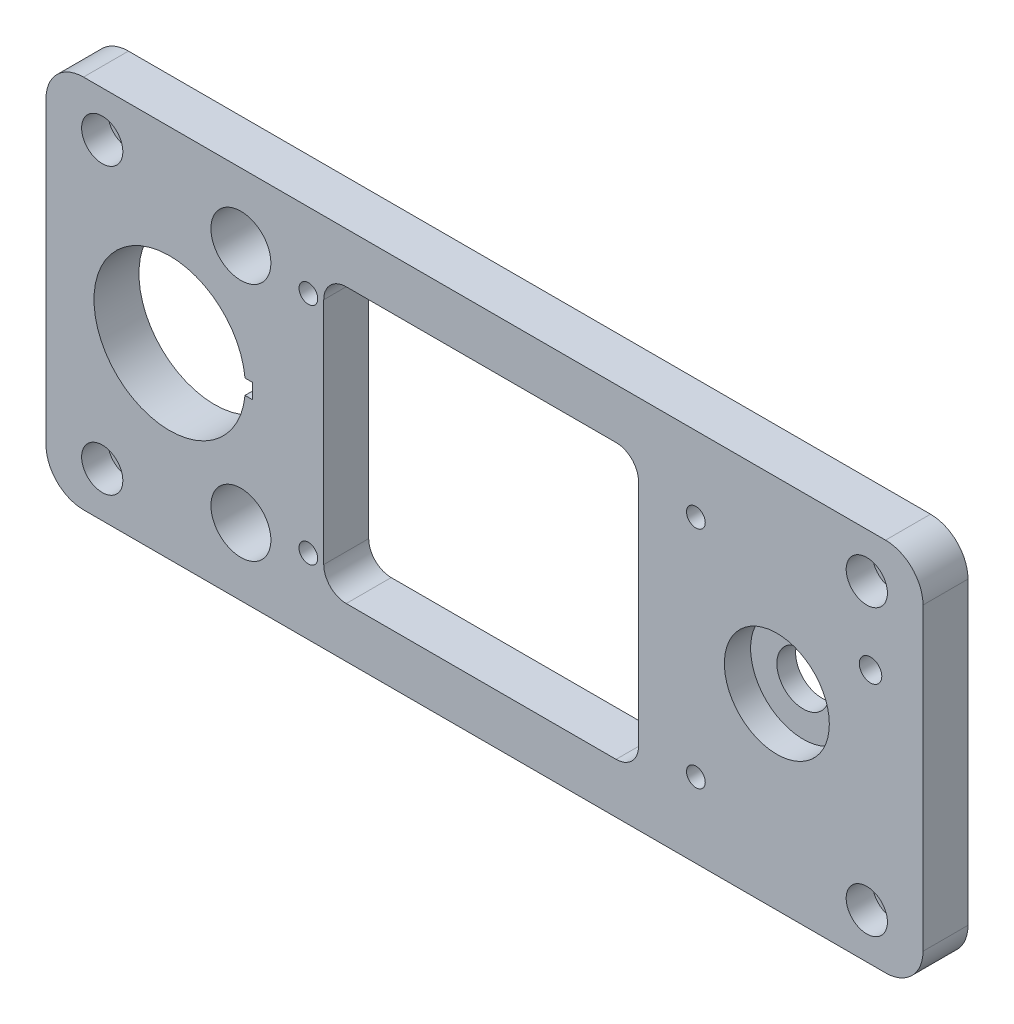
ISO-10303-21;
HEADER;
FILE_DESCRIPTION(('STEP AP214'),'2;1');
FILE_NAME('part.step','',(''),(''),'','','');
FILE_SCHEMA(('AUTOMOTIVE_DESIGN { 1 0 10303 214 1 1 1 1 }'));
ENDSEC;
DATA;
#1=APPLICATION_CONTEXT('core data for automotive mechanical design processes');
#2=APPLICATION_PROTOCOL_DEFINITION('international standard','automotive_design',2000,#1);
#3=PRODUCT_CONTEXT('',#1,'mechanical');
#4=PRODUCT('Part','Part','',(#3));
#5=PRODUCT_RELATED_PRODUCT_CATEGORY('part','',(#4));
#6=PRODUCT_DEFINITION_FORMATION('','',#4);
#7=PRODUCT_DEFINITION_CONTEXT('part definition',#1,'design');
#8=PRODUCT_DEFINITION('design','',#6,#7);
#9=PRODUCT_DEFINITION_SHAPE('','',#8);
#10=(LENGTH_UNIT() NAMED_UNIT(*) SI_UNIT(.MILLI.,.METRE.));
#11=(NAMED_UNIT(*) PLANE_ANGLE_UNIT() SI_UNIT($,.RADIAN.));
#12=(NAMED_UNIT(*) SI_UNIT($,.STERADIAN.) SOLID_ANGLE_UNIT());
#13=UNCERTAINTY_MEASURE_WITH_UNIT(LENGTH_MEASURE(1.E-05),#10,'distance_accuracy_value','');
#14=(GEOMETRIC_REPRESENTATION_CONTEXT(3) GLOBAL_UNCERTAINTY_ASSIGNED_CONTEXT((#13)) GLOBAL_UNIT_ASSIGNED_CONTEXT((#10,
#11,#12)) REPRESENTATION_CONTEXT('',''));
#15=CARTESIAN_POINT('',(0.,0.,0.));
#16=DIRECTION('',(0.,0.,1.));
#17=DIRECTION('',(1.,0.,0.));
#18=AXIS2_PLACEMENT_3D('',#15,#16,#17);
#19=CARTESIAN_POINT('',(97.500085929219,24.999938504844,6.));
#20=DIRECTION('',(0.,0.,-1.));
#21=DIRECTION('',(-1.,0.,0.));
#22=AXIS2_PLACEMENT_3D('',#19,#20,#21);
#23=CYLINDRICAL_SURFACE('',#22,3.50000000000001);
#24=CARTESIAN_POINT('',(97.500085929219,24.999938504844,0.));
#25=DIRECTION('',(0.,0.,1.));
#26=DIRECTION('',(1.,0.,0.));
#27=AXIS2_PLACEMENT_3D('',#24,#25,#26);
#28=CIRCLE('',#27,3.50000000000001);
#29=CARTESIAN_POINT('',(101.000085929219,24.999938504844,0.));
#30=VERTEX_POINT('',#29);
#31=EDGE_CURVE('E297',#30,#30,#28,.T.);
#32=ORIENTED_EDGE('',*,*,#31,.F.);
#33=EDGE_LOOP('',(#32));
#34=FACE_BOUND('',#33,.T.);
#35=CARTESIAN_POINT('',(97.500085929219,24.999938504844,2.5));
#36=DIRECTION('',(0.,0.,1.));
#37=DIRECTION('',(1.,0.,0.));
#38=AXIS2_PLACEMENT_3D('',#35,#36,#37);
#39=CIRCLE('',#38,3.50000000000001);
#40=CARTESIAN_POINT('',(101.000085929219,24.999938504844,2.5));
#41=VERTEX_POINT('',#40);
#42=EDGE_CURVE('E36',#41,#41,#39,.T.);
#43=ORIENTED_EDGE('',*,*,#42,.T.);
#44=EDGE_LOOP('',(#43));
#45=FACE_BOUND('',#44,.T.);
#46=ADVANCED_FACE('F32',(#34,#45),#23,.F.);
#47=CARTESIAN_POINT('',(109.5,6.00000000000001,6.));
#48=DIRECTION('',(0.,0.,-1.));
#49=DIRECTION('',(-1.,0.,0.));
#50=AXIS2_PLACEMENT_3D('',#47,#48,#49);
#51=CYLINDRICAL_SURFACE('',#50,1.75);
#52=CARTESIAN_POINT('',(109.5,6.00000000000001,0.));
#53=DIRECTION('',(0.,0.,1.));
#54=DIRECTION('',(1.,0.,0.));
#55=AXIS2_PLACEMENT_3D('',#52,#53,#54);
#56=CIRCLE('',#55,1.75);
#57=CARTESIAN_POINT('',(111.25,6.00000000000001,0.));
#58=VERTEX_POINT('',#57);
#59=EDGE_CURVE('E305',#58,#58,#56,.T.);
#60=ORIENTED_EDGE('',*,*,#59,.F.);
#61=EDGE_LOOP('',(#60));
#62=FACE_BOUND('',#61,.T.);
#63=CARTESIAN_POINT('',(109.5,6.00000000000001,2.5));
#64=DIRECTION('',(0.,0.,1.));
#65=DIRECTION('',(1.,0.,0.));
#66=AXIS2_PLACEMENT_3D('',#63,#64,#65);
#67=CIRCLE('',#66,1.75);
#68=CARTESIAN_POINT('',(111.25,6.00000000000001,2.5));
#69=VERTEX_POINT('',#68);
#70=EDGE_CURVE('E382',#69,#69,#67,.T.);
#71=ORIENTED_EDGE('',*,*,#70,.T.);
#72=EDGE_LOOP('',(#71));
#73=FACE_BOUND('',#72,.T.);
#74=ADVANCED_FACE('F440',(#62,#73),#51,.F.);
#75=CARTESIAN_POINT('',(109.5,44.,6.));
#76=DIRECTION('',(0.,0.,-1.));
#77=DIRECTION('',(-1.,0.,0.));
#78=AXIS2_PLACEMENT_3D('',#75,#76,#77);
#79=CYLINDRICAL_SURFACE('',#78,1.75);
#80=CARTESIAN_POINT('',(109.5,44.,0.));
#81=DIRECTION('',(0.,0.,1.));
#82=DIRECTION('',(-1.,0.,0.));
#83=AXIS2_PLACEMENT_3D('',#80,#81,#82);
#84=CIRCLE('',#83,1.75);
#85=CARTESIAN_POINT('',(107.75,44.,0.));
#86=VERTEX_POINT('',#85);
#87=EDGE_CURVE('E311',#86,#86,#84,.T.);
#88=ORIENTED_EDGE('',*,*,#87,.F.);
#89=EDGE_LOOP('',(#88));
#90=FACE_BOUND('',#89,.T.);
#91=CARTESIAN_POINT('',(109.5,44.,2.5));
#92=DIRECTION('',(0.,0.,1.));
#93=DIRECTION('',(1.,0.,0.));
#94=AXIS2_PLACEMENT_3D('',#91,#92,#93);
#95=CIRCLE('',#94,1.75);
#96=CARTESIAN_POINT('',(111.25,44.,2.5));
#97=VERTEX_POINT('',#96);
#98=EDGE_CURVE('E378',#97,#97,#95,.T.);
#99=ORIENTED_EDGE('',*,*,#98,.T.);
#100=EDGE_LOOP('',(#99));
#101=FACE_BOUND('',#100,.T.);
#102=ADVANCED_FACE('F446',(#90,#101),#79,.F.);
#103=CARTESIAN_POINT('',(7.49999999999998,6.00000000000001,6.));
#104=DIRECTION('',(0.,0.,-1.));
#105=DIRECTION('',(-1.,0.,0.));
#106=AXIS2_PLACEMENT_3D('',#103,#104,#105);
#107=CYLINDRICAL_SURFACE('',#106,1.75);
#108=CARTESIAN_POINT('',(7.49999999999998,6.00000000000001,0.));
#109=DIRECTION('',(0.,0.,1.));
#110=DIRECTION('',(-1.,0.,0.));
#111=AXIS2_PLACEMENT_3D('',#108,#109,#110);
#112=CIRCLE('',#111,1.75);
#113=CARTESIAN_POINT('',(5.74999999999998,6.00000000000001,0.));
#114=VERTEX_POINT('',#113);
#115=EDGE_CURVE('E302',#114,#114,#112,.T.);
#116=ORIENTED_EDGE('',*,*,#115,.F.);
#117=EDGE_LOOP('',(#116));
#118=FACE_BOUND('',#117,.T.);
#119=CARTESIAN_POINT('',(7.49999999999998,6.00000000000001,2.5));
#120=DIRECTION('',(0.,0.,1.));
#121=DIRECTION('',(1.,0.,0.));
#122=AXIS2_PLACEMENT_3D('',#119,#120,#121);
#123=CIRCLE('',#122,1.75);
#124=CARTESIAN_POINT('',(9.24999999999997,6.00000000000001,2.5));
#125=VERTEX_POINT('',#124);
#126=EDGE_CURVE('E373',#125,#125,#123,.T.);
#127=ORIENTED_EDGE('',*,*,#126,.T.);
#128=EDGE_LOOP('',(#127));
#129=FACE_BOUND('',#128,.T.);
#130=ADVANCED_FACE('F455',(#118,#129),#107,.F.);
#131=CARTESIAN_POINT('',(7.49999999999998,44.,6.));
#132=DIRECTION('',(0.,0.,-1.));
#133=DIRECTION('',(-1.,0.,0.));
#134=AXIS2_PLACEMENT_3D('',#131,#132,#133);
#135=CYLINDRICAL_SURFACE('',#134,1.75);
#136=CARTESIAN_POINT('',(7.49999999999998,44.,0.));
#137=DIRECTION('',(0.,0.,1.));
#138=DIRECTION('',(1.,0.,0.));
#139=AXIS2_PLACEMENT_3D('',#136,#137,#138);
#140=CIRCLE('',#139,1.75);
#141=CARTESIAN_POINT('',(9.24999999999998,44.,0.));
#142=VERTEX_POINT('',#141);
#143=EDGE_CURVE('E308',#142,#142,#140,.T.);
#144=ORIENTED_EDGE('',*,*,#143,.F.);
#145=EDGE_LOOP('',(#144));
#146=FACE_BOUND('',#145,.T.);
#147=CARTESIAN_POINT('',(7.49999999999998,44.,2.5));
#148=DIRECTION('',(0.,0.,1.));
#149=DIRECTION('',(1.,0.,0.));
#150=AXIS2_PLACEMENT_3D('',#147,#148,#149);
#151=CIRCLE('',#150,1.75);
#152=CARTESIAN_POINT('',(9.24999999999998,44.,2.5));
#153=VERTEX_POINT('',#152);
#154=EDGE_CURVE('E368',#153,#153,#151,.T.);
#155=ORIENTED_EDGE('',*,*,#154,.T.);
#156=EDGE_LOOP('',(#155));
#157=FACE_BOUND('',#156,.T.);
#158=ADVANCED_FACE('F457',(#146,#157),#135,.F.);
#159=CARTESIAN_POINT('',(5.,5.,6.));
#160=DIRECTION('',(0.,0.,-1.));
#161=DIRECTION('',(-1.,0.,0.));
#162=AXIS2_PLACEMENT_3D('',#159,#160,#161);
#163=PLANE('',#162);
#164=CARTESIAN_POINT('',(97.500085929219,24.999938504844,6.));
#165=DIRECTION('',(0.,0.,1.));
#166=DIRECTION('',(1.,0.,0.));
#167=AXIS2_PLACEMENT_3D('',#164,#165,#166);
#168=CIRCLE('',#167,7.);
#169=CARTESIAN_POINT('',(104.500085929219,24.999938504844,6.));
#170=VERTEX_POINT('',#169);
#171=EDGE_CURVE('E398',#170,#170,#168,.T.);
#172=ORIENTED_EDGE('',*,*,#171,.F.);
#173=EDGE_LOOP('',(#172));
#174=FACE_BOUND('',#173,.T.);
#175=CARTESIAN_POINT('',(109.5,6.00000000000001,6.));
#176=DIRECTION('',(0.,0.,1.));
#177=DIRECTION('',(1.,0.,0.));
#178=AXIS2_PLACEMENT_3D('',#175,#176,#177);
#179=CIRCLE('',#178,2.75000000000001);
#180=CARTESIAN_POINT('',(112.25,6.00000000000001,6.));
#181=VERTEX_POINT('',#180);
#182=EDGE_CURVE('E391',#181,#181,#179,.T.);
#183=ORIENTED_EDGE('',*,*,#182,.F.);
#184=EDGE_LOOP('',(#183));
#185=FACE_BOUND('',#184,.T.);
#186=CARTESIAN_POINT('',(109.5,44.,6.));
#187=DIRECTION('',(0.,0.,1.));
#188=DIRECTION('',(1.,0.,0.));
#189=AXIS2_PLACEMENT_3D('',#186,#187,#188);
#190=CIRCLE('',#189,2.75000000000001);
#191=CARTESIAN_POINT('',(112.25,44.,6.));
#192=VERTEX_POINT('',#191);
#193=EDGE_CURVE('E384',#192,#192,#190,.T.);
#194=ORIENTED_EDGE('',*,*,#193,.F.);
#195=EDGE_LOOP('',(#194));
#196=FACE_BOUND('',#195,.T.);
#197=CARTESIAN_POINT('',(7.49999999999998,6.00000000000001,6.));
#198=DIRECTION('',(0.,0.,1.));
#199=DIRECTION('',(1.,0.,0.));
#200=AXIS2_PLACEMENT_3D('',#197,#198,#199);
#201=CIRCLE('',#200,2.75);
#202=CARTESIAN_POINT('',(10.25,6.00000000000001,6.));
#203=VERTEX_POINT('',#202);
#204=EDGE_CURVE('E380',#203,#203,#201,.T.);
#205=ORIENTED_EDGE('',*,*,#204,.F.);
#206=EDGE_LOOP('',(#205));
#207=FACE_BOUND('',#206,.T.);
#208=CARTESIAN_POINT('',(7.49999999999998,44.,6.));
#209=DIRECTION('',(0.,0.,1.));
#210=DIRECTION('',(1.,0.,0.));
#211=AXIS2_PLACEMENT_3D('',#208,#209,#210);
#212=CIRCLE('',#211,2.75);
#213=CARTESIAN_POINT('',(10.25,44.,6.));
#214=VERTEX_POINT('',#213);
#215=EDGE_CURVE('E376',#214,#214,#212,.T.);
#216=ORIENTED_EDGE('',*,*,#215,.F.);
#217=EDGE_LOOP('',(#216));
#218=FACE_BOUND('',#217,.T.);
#219=CARTESIAN_POINT('',(26.,41.,6.));
#220=DIRECTION('',(0.,0.,1.));
#221=DIRECTION('',(1.,0.,0.));
#222=AXIS2_PLACEMENT_3D('',#219,#220,#221);
#223=CIRCLE('',#222,4.);
#224=CARTESIAN_POINT('',(30.,41.,6.));
#225=VERTEX_POINT('',#224);
#226=EDGE_CURVE('E201',#225,#225,#223,.T.);
#227=ORIENTED_EDGE('',*,*,#226,.F.);
#228=EDGE_LOOP('',(#227));
#229=FACE_BOUND('',#228,.T.);
#230=CARTESIAN_POINT('',(110.,34.,6.));
#231=DIRECTION('',(0.,0.,1.));
#232=DIRECTION('',(1.,0.,0.));
#233=AXIS2_PLACEMENT_3D('',#230,#231,#232);
#234=CIRCLE('',#233,1.5);
#235=CARTESIAN_POINT('',(111.5,34.,6.));
#236=VERTEX_POINT('',#235);
#237=EDGE_CURVE('E211',#236,#236,#234,.T.);
#238=ORIENTED_EDGE('',*,*,#237,.F.);
#239=EDGE_LOOP('',(#238));
#240=FACE_BOUND('',#239,.T.);
#241=CARTESIAN_POINT('',(35.00040108,40.00000238,6.));
#242=DIRECTION('',(0.,0.,1.));
#243=DIRECTION('',(1.,0.,0.));
#244=AXIS2_PLACEMENT_3D('',#241,#242,#243);
#245=CIRCLE('',#244,1.25);
#246=CARTESIAN_POINT('',(36.25040108,40.00000238,6.));
#247=VERTEX_POINT('',#246);
#248=EDGE_CURVE('E276',#247,#247,#245,.T.);
#249=ORIENTED_EDGE('',*,*,#248,.F.);
#250=EDGE_LOOP('',(#249));
#251=FACE_BOUND('',#250,.T.);
#252=CARTESIAN_POINT('',(35.00040108,10.00000142,6.));
#253=DIRECTION('',(0.,0.,1.));
#254=DIRECTION('',(1.,0.,0.));
#255=AXIS2_PLACEMENT_3D('',#252,#253,#254);
#256=CIRCLE('',#255,1.25);
#257=CARTESIAN_POINT('',(36.25040108,10.00000142,6.));
#258=VERTEX_POINT('',#257);
#259=EDGE_CURVE('E288',#258,#258,#256,.T.);
#260=ORIENTED_EDGE('',*,*,#259,.F.);
#261=EDGE_LOOP('',(#260));
#262=FACE_BOUND('',#261,.T.);
#263=CARTESIAN_POINT('',(5.,5.,6.));
#264=DIRECTION('',(0.,0.,1.));
#265=DIRECTION('',(-1.,0.,0.));
#266=AXIS2_PLACEMENT_3D('',#263,#264,#265);
#267=CIRCLE('',#266,5.);
#268=CARTESIAN_POINT('',(0.,5.,6.));
#269=VERTEX_POINT('',#268);
#270=CARTESIAN_POINT('',(5.,0.,6.));
#271=VERTEX_POINT('',#270);
#272=EDGE_CURVE('E315',#269,#271,#267,.T.);
#273=ORIENTED_EDGE('',*,*,#272,.T.);
#274=DIRECTION('',(1.,0.,0.));
#275=VECTOR('',#274,1.);
#276=CARTESIAN_POINT('',(5.,0.,6.));
#277=LINE('',#276,#275);
#278=CARTESIAN_POINT('',(112.,0.,6.));
#279=VERTEX_POINT('',#278);
#280=EDGE_CURVE('E318',#271,#279,#277,.T.);
#281=ORIENTED_EDGE('',*,*,#280,.T.);
#282=CARTESIAN_POINT('',(112.,5.00000000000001,6.));
#283=DIRECTION('',(0.,0.,1.));
#284=DIRECTION('',(1.,0.,0.));
#285=AXIS2_PLACEMENT_3D('',#282,#283,#284);
#286=CIRCLE('',#285,5.00000000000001);
#287=CARTESIAN_POINT('',(117.,5.00000000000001,6.));
#288=VERTEX_POINT('',#287);
#289=EDGE_CURVE('E321',#279,#288,#286,.T.);
#290=ORIENTED_EDGE('',*,*,#289,.T.);
#291=DIRECTION('',(0.,1.,0.));
#292=VECTOR('',#291,1.);
#293=CARTESIAN_POINT('',(117.,45.,6.));
#294=LINE('',#293,#292);
#295=CARTESIAN_POINT('',(117.,45.,6.));
#296=VERTEX_POINT('',#295);
#297=EDGE_CURVE('E323',#288,#296,#294,.T.);
#298=ORIENTED_EDGE('',*,*,#297,.T.);
#299=CARTESIAN_POINT('',(112.,45.,6.));
#300=DIRECTION('',(0.,0.,1.));
#301=DIRECTION('',(1.,0.,0.));
#302=AXIS2_PLACEMENT_3D('',#299,#300,#301);
#303=CIRCLE('',#302,5.00000000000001);
#304=CARTESIAN_POINT('',(112.,50.,6.));
#305=VERTEX_POINT('',#304);
#306=EDGE_CURVE('E325',#296,#305,#303,.T.);
#307=ORIENTED_EDGE('',*,*,#306,.T.);
#308=DIRECTION('',(-1.,0.,0.));
#309=VECTOR('',#308,1.);
#310=CARTESIAN_POINT('',(5.,50.,6.));
#311=LINE('',#310,#309);
#312=CARTESIAN_POINT('',(5.,50.,6.));
#313=VERTEX_POINT('',#312);
#314=EDGE_CURVE('E327',#305,#313,#311,.T.);
#315=ORIENTED_EDGE('',*,*,#314,.T.);
#316=CARTESIAN_POINT('',(4.99999999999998,45.,6.));
#317=DIRECTION('',(0.,0.,1.));
#318=DIRECTION('',(1.,0.,0.));
#319=AXIS2_PLACEMENT_3D('',#316,#317,#318);
#320=CIRCLE('',#319,5.00000000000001);
#321=CARTESIAN_POINT('',(0.,45.,6.));
#322=VERTEX_POINT('',#321);
#323=EDGE_CURVE('E329',#313,#322,#320,.T.);
#324=ORIENTED_EDGE('',*,*,#323,.T.);
#325=DIRECTION('',(0.,-1.,0.));
#326=VECTOR('',#325,1.);
#327=CARTESIAN_POINT('',(0.,5.,6.));
#328=LINE('',#327,#326);
#329=EDGE_CURVE('E331',#322,#269,#328,.T.);
#330=ORIENTED_EDGE('',*,*,#329,.T.);
#331=EDGE_LOOP('',(#273,#281,#290,#298,#307,#315,#324,#330));
#332=FACE_BOUND('',#331,.T.);
#333=CARTESIAN_POINT('',(86.70040182,40.00000238,6.));
#334=DIRECTION('',(0.,0.,1.));
#335=DIRECTION('',(1.,0.,0.));
#336=AXIS2_PLACEMENT_3D('',#333,#334,#335);
#337=CIRCLE('',#336,1.25000004);
#338=CARTESIAN_POINT('',(87.95040186,40.00000238,6.));
#339=VERTEX_POINT('',#338);
#340=EDGE_CURVE('E294',#339,#339,#337,.T.);
#341=ORIENTED_EDGE('',*,*,#340,.F.);
#342=EDGE_LOOP('',(#341));
#343=FACE_BOUND('',#342,.T.);
#344=CARTESIAN_POINT('',(86.70040182,10.00000142,6.));
#345=DIRECTION('',(0.,0.,1.));
#346=DIRECTION('',(1.,0.,0.));
#347=AXIS2_PLACEMENT_3D('',#344,#345,#346);
#348=CIRCLE('',#347,1.25);
#349=CARTESIAN_POINT('',(87.95040182,10.00000142,6.));
#350=VERTEX_POINT('',#349);
#351=EDGE_CURVE('E282',#350,#350,#348,.T.);
#352=ORIENTED_EDGE('',*,*,#351,.F.);
#353=EDGE_LOOP('',(#352));
#354=FACE_BOUND('',#353,.T.);
#355=CARTESIAN_POINT('',(40.0503543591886,9.70006031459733,6.));
#356=DIRECTION('',(0.,0.,1.));
#357=DIRECTION('',(-1.,0.,0.));
#358=AXIS2_PLACEMENT_3D('',#355,#356,#357);
#359=CIRCLE('',#358,3.);
#360=CARTESIAN_POINT('',(37.0503543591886,9.70006031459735,6.));
#361=VERTEX_POINT('',#360);
#362=CARTESIAN_POINT('',(40.0503543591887,6.70006031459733,6.));
#363=VERTEX_POINT('',#362);
#364=EDGE_CURVE('E217',#361,#363,#359,.T.);
#365=ORIENTED_EDGE('',*,*,#364,.F.);
#366=DIRECTION('',(0.,-1.,0.));
#367=VECTOR('',#366,1.);
#368=CARTESIAN_POINT('',(37.0503543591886,9.70006031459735,6.));
#369=LINE('',#368,#367);
#370=CARTESIAN_POINT('',(37.0503543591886,40.3000603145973,6.));
#371=VERTEX_POINT('',#370);
#372=EDGE_CURVE('E233',#371,#361,#369,.T.);
#373=ORIENTED_EDGE('',*,*,#372,.F.);
#374=CARTESIAN_POINT('',(40.0503543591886,40.3000603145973,6.));
#375=DIRECTION('',(0.,0.,1.));
#376=DIRECTION('',(1.,0.,0.));
#377=AXIS2_PLACEMENT_3D('',#374,#375,#376);
#378=CIRCLE('',#377,3.);
#379=CARTESIAN_POINT('',(40.0503543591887,43.3000603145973,6.));
#380=VERTEX_POINT('',#379);
#381=EDGE_CURVE('E230',#380,#371,#378,.T.);
#382=ORIENTED_EDGE('',*,*,#381,.F.);
#383=DIRECTION('',(-1.,0.,0.));
#384=VECTOR('',#383,1.);
#385=CARTESIAN_POINT('',(40.0503543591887,43.3000603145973,6.));
#386=LINE('',#385,#384);
#387=CARTESIAN_POINT('',(76.0503543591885,43.3000603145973,6.));
#388=VERTEX_POINT('',#387);
#389=EDGE_CURVE('E228',#388,#380,#386,.T.);
#390=ORIENTED_EDGE('',*,*,#389,.F.);
#391=CARTESIAN_POINT('',(76.0503543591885,40.3000603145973,6.));
#392=DIRECTION('',(0.,0.,1.));
#393=DIRECTION('',(-1.,0.,0.));
#394=AXIS2_PLACEMENT_3D('',#391,#392,#393);
#395=CIRCLE('',#394,3.);
#396=CARTESIAN_POINT('',(79.0503543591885,40.3000603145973,6.));
#397=VERTEX_POINT('',#396);
#398=EDGE_CURVE('E226',#397,#388,#395,.T.);
#399=ORIENTED_EDGE('',*,*,#398,.F.);
#400=DIRECTION('',(0.,1.,0.));
#401=VECTOR('',#400,1.);
#402=CARTESIAN_POINT('',(79.0503543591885,40.3000603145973,6.));
#403=LINE('',#402,#401);
#404=CARTESIAN_POINT('',(79.0503543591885,9.70006031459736,6.));
#405=VERTEX_POINT('',#404);
#406=EDGE_CURVE('E224',#405,#397,#403,.T.);
#407=ORIENTED_EDGE('',*,*,#406,.F.);
#408=CARTESIAN_POINT('',(76.0503543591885,9.70006031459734,6.));
#409=DIRECTION('',(0.,0.,1.));
#410=DIRECTION('',(-1.,0.,0.));
#411=AXIS2_PLACEMENT_3D('',#408,#409,#410);
#412=CIRCLE('',#411,3.);
#413=CARTESIAN_POINT('',(76.0503543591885,6.70006031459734,6.));
#414=VERTEX_POINT('',#413);
#415=EDGE_CURVE('E222',#414,#405,#412,.T.);
#416=ORIENTED_EDGE('',*,*,#415,.F.);
#417=DIRECTION('',(1.,0.,0.));
#418=VECTOR('',#417,1.);
#419=CARTESIAN_POINT('',(76.0503543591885,6.70006031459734,6.));
#420=LINE('',#419,#418);
#421=EDGE_CURVE('E219',#363,#414,#420,.T.);
#422=ORIENTED_EDGE('',*,*,#421,.F.);
#423=EDGE_LOOP('',(#365,#373,#382,#390,#399,#407,#416,#422));
#424=FACE_BOUND('',#423,.T.);
#425=DIRECTION('',(0.,1.,0.));
#426=VECTOR('',#425,1.);
#427=CARTESIAN_POINT('',(27.5503731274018,26.,6.));
#428=LINE('',#427,#426);
#429=CARTESIAN_POINT('',(27.5503731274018,24.,6.));
#430=VERTEX_POINT('',#429);
#431=CARTESIAN_POINT('',(27.5503731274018,26.,6.));
#432=VERTEX_POINT('',#431);
#433=EDGE_CURVE('E171',#430,#432,#428,.T.);
#434=ORIENTED_EDGE('',*,*,#433,.F.);
#435=DIRECTION('',(1.,0.,0.));
#436=VECTOR('',#435,1.);
#437=CARTESIAN_POINT('',(27.5503731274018,24.,6.));
#438=LINE('',#437,#436);
#439=CARTESIAN_POINT('',(26.5503731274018,24.,6.));
#440=VERTEX_POINT('',#439);
#441=EDGE_CURVE('E195',#440,#430,#438,.T.);
#442=ORIENTED_EDGE('',*,*,#441,.F.);
#443=CARTESIAN_POINT('',(16.5,25.,6.));
#444=DIRECTION('',(0.,0.,1.));
#445=DIRECTION('',(1.,0.,0.));
#446=AXIS2_PLACEMENT_3D('',#443,#444,#445);
#447=CIRCLE('',#446,10.1);
#448=CARTESIAN_POINT('',(26.5503731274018,26.,6.));
#449=VERTEX_POINT('',#448);
#450=EDGE_CURVE('E193',#449,#440,#447,.T.);
#451=ORIENTED_EDGE('',*,*,#450,.F.);
#452=DIRECTION('',(-1.,0.,0.));
#453=VECTOR('',#452,1.);
#454=CARTESIAN_POINT('',(27.5503731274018,26.,6.));
#455=LINE('',#454,#453);
#456=EDGE_CURVE('E179',#432,#449,#455,.T.);
#457=ORIENTED_EDGE('',*,*,#456,.F.);
#458=EDGE_LOOP('',(#434,#442,#451,#457));
#459=FACE_BOUND('',#458,.T.);
#460=CARTESIAN_POINT('',(26.,9.,6.));
#461=DIRECTION('',(0.,0.,1.));
#462=DIRECTION('',(-1.,0.,0.));
#463=AXIS2_PLACEMENT_3D('',#460,#461,#462);
#464=CIRCLE('',#463,4.);
#465=CARTESIAN_POINT('',(22.,9.,6.));
#466=VERTEX_POINT('',#465);
#467=EDGE_CURVE('E411',#466,#466,#464,.T.);
#468=ORIENTED_EDGE('',*,*,#467,.F.);
#469=EDGE_LOOP('',(#468));
#470=FACE_BOUND('',#469,.T.);
#471=ADVANCED_FACE('F191',(#174,#185,#196,#207,#218,#229,#240,#251,#262,#332,#343,#354,#424,
#459,#470),#163,.F.);
#472=CARTESIAN_POINT('',(5.,5.,0.));
#473=DIRECTION('',(0.,0.,-1.));
#474=DIRECTION('',(-1.,0.,0.));
#475=AXIS2_PLACEMENT_3D('',#472,#473,#474);
#476=PLANE('',#475);
#477=CARTESIAN_POINT('',(26.,41.,0.));
#478=DIRECTION('',(0.,0.,1.));
#479=DIRECTION('',(1.,0.,0.));
#480=AXIS2_PLACEMENT_3D('',#477,#478,#479);
#481=CIRCLE('',#480,4.);
#482=CARTESIAN_POINT('',(30.,41.,0.));
#483=VERTEX_POINT('',#482);
#484=EDGE_CURVE('E414',#483,#483,#481,.T.);
#485=ORIENTED_EDGE('',*,*,#484,.T.);
#486=EDGE_LOOP('',(#485));
#487=FACE_BOUND('',#486,.T.);
#488=CARTESIAN_POINT('',(110.,34.,0.));
#489=DIRECTION('',(0.,0.,1.));
#490=DIRECTION('',(1.,0.,0.));
#491=AXIS2_PLACEMENT_3D('',#488,#489,#490);
#492=CIRCLE('',#491,1.5);
#493=CARTESIAN_POINT('',(111.5,34.,0.));
#494=VERTEX_POINT('',#493);
#495=EDGE_CURVE('E187',#494,#494,#492,.T.);
#496=ORIENTED_EDGE('',*,*,#495,.T.);
#497=EDGE_LOOP('',(#496));
#498=FACE_BOUND('',#497,.T.);
#499=CARTESIAN_POINT('',(35.00040108,40.00000238,0.));
#500=DIRECTION('',(0.,0.,1.));
#501=DIRECTION('',(1.,0.,0.));
#502=AXIS2_PLACEMENT_3D('',#499,#500,#501);
#503=CIRCLE('',#502,1.25);
#504=CARTESIAN_POINT('',(36.25040108,40.00000238,0.));
#505=VERTEX_POINT('',#504);
#506=EDGE_CURVE('E275',#505,#505,#503,.T.);
#507=ORIENTED_EDGE('',*,*,#506,.T.);
#508=EDGE_LOOP('',(#507));
#509=FACE_BOUND('',#508,.T.);
#510=CARTESIAN_POINT('',(35.00040108,10.00000142,0.));
#511=DIRECTION('',(0.,0.,1.));
#512=DIRECTION('',(1.,0.,0.));
#513=AXIS2_PLACEMENT_3D('',#510,#511,#512);
#514=CIRCLE('',#513,1.25);
#515=CARTESIAN_POINT('',(36.25040108,10.00000142,0.));
#516=VERTEX_POINT('',#515);
#517=EDGE_CURVE('E285',#516,#516,#514,.T.);
#518=ORIENTED_EDGE('',*,*,#517,.T.);
#519=EDGE_LOOP('',(#518));
#520=FACE_BOUND('',#519,.T.);
#521=ORIENTED_EDGE('',*,*,#31,.T.);
#522=EDGE_LOOP('',(#521));
#523=FACE_BOUND('',#522,.T.);
#524=ORIENTED_EDGE('',*,*,#59,.T.);
#525=EDGE_LOOP('',(#524));
#526=FACE_BOUND('',#525,.T.);
#527=ORIENTED_EDGE('',*,*,#87,.T.);
#528=EDGE_LOOP('',(#527));
#529=FACE_BOUND('',#528,.T.);
#530=CARTESIAN_POINT('',(5.,5.,0.));
#531=DIRECTION('',(0.,0.,1.));
#532=DIRECTION('',(-1.,0.,0.));
#533=AXIS2_PLACEMENT_3D('',#530,#531,#532);
#534=CIRCLE('',#533,5.);
#535=CARTESIAN_POINT('',(0.,5.,0.));
#536=VERTEX_POINT('',#535);
#537=CARTESIAN_POINT('',(5.,0.,0.));
#538=VERTEX_POINT('',#537);
#539=EDGE_CURVE('E314',#536,#538,#534,.T.);
#540=ORIENTED_EDGE('',*,*,#539,.F.);
#541=DIRECTION('',(0.,-1.,0.));
#542=VECTOR('',#541,1.);
#543=CARTESIAN_POINT('',(0.,5.,0.));
#544=LINE('',#543,#542);
#545=CARTESIAN_POINT('',(0.,45.,0.));
#546=VERTEX_POINT('',#545);
#547=EDGE_CURVE('E319',#546,#536,#544,.T.);
#548=ORIENTED_EDGE('',*,*,#547,.F.);
#549=CARTESIAN_POINT('',(4.99999999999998,45.,0.));
#550=DIRECTION('',(0.,0.,1.));
#551=DIRECTION('',(1.,0.,0.));
#552=AXIS2_PLACEMENT_3D('',#549,#550,#551);
#553=CIRCLE('',#552,5.00000000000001);
#554=CARTESIAN_POINT('',(5.,50.,0.));
#555=VERTEX_POINT('',#554);
#556=EDGE_CURVE('E346',#555,#546,#553,.T.);
#557=ORIENTED_EDGE('',*,*,#556,.F.);
#558=DIRECTION('',(-1.,0.,0.));
#559=VECTOR('',#558,1.);
#560=CARTESIAN_POINT('',(5.,50.,0.));
#561=LINE('',#560,#559);
#562=CARTESIAN_POINT('',(112.,50.,0.));
#563=VERTEX_POINT('',#562);
#564=EDGE_CURVE('E344',#563,#555,#561,.T.);
#565=ORIENTED_EDGE('',*,*,#564,.F.);
#566=CARTESIAN_POINT('',(112.,45.,0.));
#567=DIRECTION('',(0.,0.,1.));
#568=DIRECTION('',(1.,0.,0.));
#569=AXIS2_PLACEMENT_3D('',#566,#567,#568);
#570=CIRCLE('',#569,5.00000000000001);
#571=CARTESIAN_POINT('',(117.,45.,0.));
#572=VERTEX_POINT('',#571);
#573=EDGE_CURVE('E342',#572,#563,#570,.T.);
#574=ORIENTED_EDGE('',*,*,#573,.F.);
#575=DIRECTION('',(0.,1.,0.));
#576=VECTOR('',#575,1.);
#577=CARTESIAN_POINT('',(117.,45.,0.));
#578=LINE('',#577,#576);
#579=CARTESIAN_POINT('',(117.,5.00000000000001,0.));
#580=VERTEX_POINT('',#579);
#581=EDGE_CURVE('E340',#580,#572,#578,.T.);
#582=ORIENTED_EDGE('',*,*,#581,.F.);
#583=CARTESIAN_POINT('',(112.,5.00000000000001,0.));
#584=DIRECTION('',(0.,0.,1.));
#585=DIRECTION('',(1.,0.,0.));
#586=AXIS2_PLACEMENT_3D('',#583,#584,#585);
#587=CIRCLE('',#586,5.00000000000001);
#588=CARTESIAN_POINT('',(112.,0.,0.));
#589=VERTEX_POINT('',#588);
#590=EDGE_CURVE('E338',#589,#580,#587,.T.);
#591=ORIENTED_EDGE('',*,*,#590,.F.);
#592=DIRECTION('',(1.,0.,0.));
#593=VECTOR('',#592,1.);
#594=CARTESIAN_POINT('',(5.,0.,0.));
#595=LINE('',#594,#593);
#596=EDGE_CURVE('E336',#538,#589,#595,.T.);
#597=ORIENTED_EDGE('',*,*,#596,.F.);
#598=EDGE_LOOP('',(#540,#548,#557,#565,#574,#582,#591,#597));
#599=FACE_BOUND('',#598,.T.);
#600=ORIENTED_EDGE('',*,*,#143,.T.);
#601=EDGE_LOOP('',(#600));
#602=FACE_BOUND('',#601,.T.);
#603=ORIENTED_EDGE('',*,*,#115,.T.);
#604=EDGE_LOOP('',(#603));
#605=FACE_BOUND('',#604,.T.);
#606=CARTESIAN_POINT('',(86.70040182,40.00000238,0.));
#607=DIRECTION('',(0.,0.,1.));
#608=DIRECTION('',(1.,0.,0.));
#609=AXIS2_PLACEMENT_3D('',#606,#607,#608);
#610=CIRCLE('',#609,1.25000004);
#611=CARTESIAN_POINT('',(87.95040186,40.00000238,0.));
#612=VERTEX_POINT('',#611);
#613=EDGE_CURVE('E291',#612,#612,#610,.T.);
#614=ORIENTED_EDGE('',*,*,#613,.T.);
#615=EDGE_LOOP('',(#614));
#616=FACE_BOUND('',#615,.T.);
#617=CARTESIAN_POINT('',(86.70040182,10.00000142,0.));
#618=DIRECTION('',(0.,0.,1.));
#619=DIRECTION('',(1.,0.,0.));
#620=AXIS2_PLACEMENT_3D('',#617,#618,#619);
#621=CIRCLE('',#620,1.25);
#622=CARTESIAN_POINT('',(87.95040182,10.00000142,0.));
#623=VERTEX_POINT('',#622);
#624=EDGE_CURVE('E279',#623,#623,#621,.T.);
#625=ORIENTED_EDGE('',*,*,#624,.T.);
#626=EDGE_LOOP('',(#625));
#627=FACE_BOUND('',#626,.T.);
#628=DIRECTION('',(0.,-1.,0.));
#629=VECTOR('',#628,1.);
#630=CARTESIAN_POINT('',(37.0503543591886,9.70006031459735,0.));
#631=LINE('',#630,#629);
#632=CARTESIAN_POINT('',(37.0503543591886,40.3000603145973,0.));
#633=VERTEX_POINT('',#632);
#634=CARTESIAN_POINT('',(37.0503543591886,9.70006031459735,0.));
#635=VERTEX_POINT('',#634);
#636=EDGE_CURVE('E220',#633,#635,#631,.T.);
#637=ORIENTED_EDGE('',*,*,#636,.T.);
#638=CARTESIAN_POINT('',(40.0503543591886,9.70006031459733,0.));
#639=DIRECTION('',(0.,0.,1.));
#640=DIRECTION('',(-1.,0.,0.));
#641=AXIS2_PLACEMENT_3D('',#638,#639,#640);
#642=CIRCLE('',#641,3.);
#643=CARTESIAN_POINT('',(40.0503543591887,6.70006031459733,0.));
#644=VERTEX_POINT('',#643);
#645=EDGE_CURVE('E214',#635,#644,#642,.T.);
#646=ORIENTED_EDGE('',*,*,#645,.T.);
#647=DIRECTION('',(1.,0.,0.));
#648=VECTOR('',#647,1.);
#649=CARTESIAN_POINT('',(76.0503543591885,6.70006031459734,0.));
#650=LINE('',#649,#648);
#651=CARTESIAN_POINT('',(76.0503543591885,6.70006031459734,0.));
#652=VERTEX_POINT('',#651);
#653=EDGE_CURVE('E238',#644,#652,#650,.T.);
#654=ORIENTED_EDGE('',*,*,#653,.T.);
#655=CARTESIAN_POINT('',(76.0503543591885,9.70006031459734,0.));
#656=DIRECTION('',(0.,0.,1.));
#657=DIRECTION('',(-1.,0.,0.));
#658=AXIS2_PLACEMENT_3D('',#655,#656,#657);
#659=CIRCLE('',#658,3.);
#660=CARTESIAN_POINT('',(79.0503543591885,9.70006031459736,0.));
#661=VERTEX_POINT('',#660);
#662=EDGE_CURVE('E241',#652,#661,#659,.T.);
#663=ORIENTED_EDGE('',*,*,#662,.T.);
#664=DIRECTION('',(0.,1.,0.));
#665=VECTOR('',#664,1.);
#666=CARTESIAN_POINT('',(79.0503543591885,40.3000603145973,0.));
#667=LINE('',#666,#665);
#668=CARTESIAN_POINT('',(79.0503543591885,40.3000603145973,0.));
#669=VERTEX_POINT('',#668);
#670=EDGE_CURVE('E244',#661,#669,#667,.T.);
#671=ORIENTED_EDGE('',*,*,#670,.T.);
#672=CARTESIAN_POINT('',(76.0503543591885,40.3000603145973,0.));
#673=DIRECTION('',(0.,0.,1.));
#674=DIRECTION('',(-1.,0.,0.));
#675=AXIS2_PLACEMENT_3D('',#672,#673,#674);
#676=CIRCLE('',#675,3.);
#677=CARTESIAN_POINT('',(76.0503543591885,43.3000603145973,0.));
#678=VERTEX_POINT('',#677);
#679=EDGE_CURVE('E247',#669,#678,#676,.T.);
#680=ORIENTED_EDGE('',*,*,#679,.T.);
#681=DIRECTION('',(-1.,0.,0.));
#682=VECTOR('',#681,1.);
#683=CARTESIAN_POINT('',(40.0503543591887,43.3000603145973,0.));
#684=LINE('',#683,#682);
#685=CARTESIAN_POINT('',(40.0503543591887,43.3000603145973,0.));
#686=VERTEX_POINT('',#685);
#687=EDGE_CURVE('E250',#678,#686,#684,.T.);
#688=ORIENTED_EDGE('',*,*,#687,.T.);
#689=CARTESIAN_POINT('',(40.0503543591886,40.3000603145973,0.));
#690=DIRECTION('',(0.,0.,1.));
#691=DIRECTION('',(1.,0.,0.));
#692=AXIS2_PLACEMENT_3D('',#689,#690,#691);
#693=CIRCLE('',#692,3.);
#694=EDGE_CURVE('E253',#686,#633,#693,.T.);
#695=ORIENTED_EDGE('',*,*,#694,.T.);
#696=EDGE_LOOP('',(#637,#646,#654,#663,#671,#680,#688,#695));
#697=FACE_BOUND('',#696,.T.);
#698=DIRECTION('',(1.,0.,0.));
#699=VECTOR('',#698,1.);
#700=CARTESIAN_POINT('',(27.5503731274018,24.,0.));
#701=LINE('',#700,#699);
#702=CARTESIAN_POINT('',(26.5503731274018,24.,0.));
#703=VERTEX_POINT('',#702);
#704=CARTESIAN_POINT('',(27.5503731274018,24.,0.));
#705=VERTEX_POINT('',#704);
#706=EDGE_CURVE('E180',#703,#705,#701,.T.);
#707=ORIENTED_EDGE('',*,*,#706,.T.);
#708=DIRECTION('',(0.,1.,0.));
#709=VECTOR('',#708,1.);
#710=CARTESIAN_POINT('',(27.5503731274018,26.,0.));
#711=LINE('',#710,#709);
#712=CARTESIAN_POINT('',(27.5503731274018,26.,0.));
#713=VERTEX_POINT('',#712);
#714=EDGE_CURVE('E57',#705,#713,#711,.T.);
#715=ORIENTED_EDGE('',*,*,#714,.T.);
#716=DIRECTION('',(-1.,0.,0.));
#717=VECTOR('',#716,1.);
#718=CARTESIAN_POINT('',(27.5503731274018,26.,0.));
#719=LINE('',#718,#717);
#720=CARTESIAN_POINT('',(26.5503731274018,26.,0.));
#721=VERTEX_POINT('',#720);
#722=EDGE_CURVE('E186',#713,#721,#719,.T.);
#723=ORIENTED_EDGE('',*,*,#722,.T.);
#724=CARTESIAN_POINT('',(16.5,25.,0.));
#725=DIRECTION('',(0.,0.,1.));
#726=DIRECTION('',(1.,0.,0.));
#727=AXIS2_PLACEMENT_3D('',#724,#725,#726);
#728=CIRCLE('',#727,10.1);
#729=EDGE_CURVE('E203',#721,#703,#728,.T.);
#730=ORIENTED_EDGE('',*,*,#729,.T.);
#731=EDGE_LOOP('',(#707,#715,#723,#730));
#732=FACE_BOUND('',#731,.T.);
#733=CARTESIAN_POINT('',(26.,9.,0.));
#734=DIRECTION('',(0.,0.,1.));
#735=DIRECTION('',(-1.,0.,0.));
#736=AXIS2_PLACEMENT_3D('',#733,#734,#735);
#737=CIRCLE('',#736,4.);
#738=CARTESIAN_POINT('',(22.,9.,0.));
#739=VERTEX_POINT('',#738);
#740=EDGE_CURVE('E371',#739,#739,#737,.T.);
#741=ORIENTED_EDGE('',*,*,#740,.T.);
#742=EDGE_LOOP('',(#741));
#743=FACE_BOUND('',#742,.T.);
#744=ADVANCED_FACE('F421',(#487,#498,#509,#520,#523,#526,#529,#599,#602,#605,#616,#627,#697,
#732,#743),#476,.T.);
#745=CARTESIAN_POINT('',(5.,5.,6.));
#746=DIRECTION('',(0.,0.,-1.));
#747=DIRECTION('',(-1.,0.,0.));
#748=AXIS2_PLACEMENT_3D('',#745,#746,#747);
#749=CYLINDRICAL_SURFACE('',#748,5.);
#750=ORIENTED_EDGE('',*,*,#539,.T.);
#751=DIRECTION('',(0.,0.,-1.));
#752=VECTOR('',#751,1.);
#753=CARTESIAN_POINT('',(5.,0.,6.));
#754=LINE('',#753,#752);
#755=EDGE_CURVE('E11',#271,#538,#754,.T.);
#756=ORIENTED_EDGE('',*,*,#755,.F.);
#757=ORIENTED_EDGE('',*,*,#272,.F.);
#758=DIRECTION('',(0.,0.,-1.));
#759=VECTOR('',#758,1.);
#760=CARTESIAN_POINT('',(0.,5.,6.));
#761=LINE('',#760,#759);
#762=EDGE_CURVE('E333',#269,#536,#761,.T.);
#763=ORIENTED_EDGE('',*,*,#762,.T.);
#764=EDGE_LOOP('',(#750,#756,#757,#763));
#765=FACE_BOUND('',#764,.T.);
#766=ADVANCED_FACE('F34',(#765),#749,.T.);
#767=CARTESIAN_POINT('',(5.,0.,6.));
#768=DIRECTION('',(0.,1.,0.));
#769=DIRECTION('',(-1.,0.,0.));
#770=AXIS2_PLACEMENT_3D('',#767,#768,#769);
#771=PLANE('',#770);
#772=ORIENTED_EDGE('',*,*,#596,.T.);
#773=DIRECTION('',(0.,0.,-1.));
#774=VECTOR('',#773,1.);
#775=CARTESIAN_POINT('',(112.,0.,6.));
#776=LINE('',#775,#774);
#777=EDGE_CURVE('E41',#279,#589,#776,.T.);
#778=ORIENTED_EDGE('',*,*,#777,.F.);
#779=ORIENTED_EDGE('',*,*,#280,.F.);
#780=ORIENTED_EDGE('',*,*,#755,.T.);
#781=EDGE_LOOP('',(#772,#778,#779,#780));
#782=FACE_BOUND('',#781,.T.);
#783=ADVANCED_FACE('F493',(#782),#771,.F.);
#784=CARTESIAN_POINT('',(112.,5.00000000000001,6.));
#785=DIRECTION('',(0.,0.,-1.));
#786=DIRECTION('',(-1.,0.,0.));
#787=AXIS2_PLACEMENT_3D('',#784,#785,#786);
#788=CYLINDRICAL_SURFACE('',#787,5.00000000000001);
#789=ORIENTED_EDGE('',*,*,#590,.T.);
#790=DIRECTION('',(0.,0.,-1.));
#791=VECTOR('',#790,1.);
#792=CARTESIAN_POINT('',(117.,5.00000000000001,6.));
#793=LINE('',#792,#791);
#794=EDGE_CURVE('E363',#288,#580,#793,.T.);
#795=ORIENTED_EDGE('',*,*,#794,.F.);
#796=ORIENTED_EDGE('',*,*,#289,.F.);
#797=ORIENTED_EDGE('',*,*,#777,.T.);
#798=EDGE_LOOP('',(#789,#795,#796,#797));
#799=FACE_BOUND('',#798,.T.);
#800=ADVANCED_FACE('F490',(#799),#788,.T.);
#801=CARTESIAN_POINT('',(117.,45.,6.));
#802=DIRECTION('',(-1.,0.,0.));
#803=DIRECTION('',(0.,0.,1.));
#804=AXIS2_PLACEMENT_3D('',#801,#802,#803);
#805=PLANE('',#804);
#806=ORIENTED_EDGE('',*,*,#581,.T.);
#807=DIRECTION('',(0.,0.,-1.));
#808=VECTOR('',#807,1.);
#809=CARTESIAN_POINT('',(117.,45.,6.));
#810=LINE('',#809,#808);
#811=EDGE_CURVE('E360',#296,#572,#810,.T.);
#812=ORIENTED_EDGE('',*,*,#811,.F.);
#813=ORIENTED_EDGE('',*,*,#297,.F.);
#814=ORIENTED_EDGE('',*,*,#794,.T.);
#815=EDGE_LOOP('',(#806,#812,#813,#814));
#816=FACE_BOUND('',#815,.T.);
#817=ADVANCED_FACE('F486',(#816),#805,.F.);
#818=CARTESIAN_POINT('',(112.,45.,6.));
#819=DIRECTION('',(0.,0.,-1.));
#820=DIRECTION('',(-1.,0.,0.));
#821=AXIS2_PLACEMENT_3D('',#818,#819,#820);
#822=CYLINDRICAL_SURFACE('',#821,5.00000000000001);
#823=ORIENTED_EDGE('',*,*,#573,.T.);
#824=DIRECTION('',(0.,0.,-1.));
#825=VECTOR('',#824,1.);
#826=CARTESIAN_POINT('',(112.,50.,6.));
#827=LINE('',#826,#825);
#828=EDGE_CURVE('E357',#305,#563,#827,.T.);
#829=ORIENTED_EDGE('',*,*,#828,.F.);
#830=ORIENTED_EDGE('',*,*,#306,.F.);
#831=ORIENTED_EDGE('',*,*,#811,.T.);
#832=EDGE_LOOP('',(#823,#829,#830,#831));
#833=FACE_BOUND('',#832,.T.);
#834=ADVANCED_FACE('F482',(#833),#822,.T.);
#835=CARTESIAN_POINT('',(5.,50.,6.));
#836=DIRECTION('',(0.,-1.,0.));
#837=DIRECTION('',(1.,0.,0.));
#838=AXIS2_PLACEMENT_3D('',#835,#836,#837);
#839=PLANE('',#838);
#840=ORIENTED_EDGE('',*,*,#564,.T.);
#841=DIRECTION('',(0.,0.,-1.));
#842=VECTOR('',#841,1.);
#843=CARTESIAN_POINT('',(5.,50.,6.));
#844=LINE('',#843,#842);
#845=EDGE_CURVE('E354',#313,#555,#844,.T.);
#846=ORIENTED_EDGE('',*,*,#845,.F.);
#847=ORIENTED_EDGE('',*,*,#314,.F.);
#848=ORIENTED_EDGE('',*,*,#828,.T.);
#849=EDGE_LOOP('',(#840,#846,#847,#848));
#850=FACE_BOUND('',#849,.T.);
#851=ADVANCED_FACE('F478',(#850),#839,.F.);
#852=CARTESIAN_POINT('',(4.99999999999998,45.,6.));
#853=DIRECTION('',(0.,0.,-1.));
#854=DIRECTION('',(-1.,0.,0.));
#855=AXIS2_PLACEMENT_3D('',#852,#853,#854);
#856=CYLINDRICAL_SURFACE('',#855,5.00000000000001);
#857=ORIENTED_EDGE('',*,*,#556,.T.);
#858=DIRECTION('',(0.,0.,-1.));
#859=VECTOR('',#858,1.);
#860=CARTESIAN_POINT('',(0.,45.,6.));
#861=LINE('',#860,#859);
#862=EDGE_CURVE('E351',#322,#546,#861,.T.);
#863=ORIENTED_EDGE('',*,*,#862,.F.);
#864=ORIENTED_EDGE('',*,*,#323,.F.);
#865=ORIENTED_EDGE('',*,*,#845,.T.);
#866=EDGE_LOOP('',(#857,#863,#864,#865));
#867=FACE_BOUND('',#866,.T.);
#868=ADVANCED_FACE('F474',(#867),#856,.T.);
#869=CARTESIAN_POINT('',(0.,5.,6.));
#870=DIRECTION('',(1.,0.,0.));
#871=DIRECTION('',(0.,1.,0.));
#872=AXIS2_PLACEMENT_3D('',#869,#870,#871);
#873=PLANE('',#872);
#874=ORIENTED_EDGE('',*,*,#547,.T.);
#875=ORIENTED_EDGE('',*,*,#762,.F.);
#876=ORIENTED_EDGE('',*,*,#329,.F.);
#877=ORIENTED_EDGE('',*,*,#862,.T.);
#878=EDGE_LOOP('',(#874,#875,#876,#877));
#879=FACE_BOUND('',#878,.T.);
#880=ADVANCED_FACE('F471',(#879),#873,.F.);
#881=CARTESIAN_POINT('',(86.70040182,40.00000238,6.));
#882=DIRECTION('',(0.,0.,-1.));
#883=DIRECTION('',(-1.,0.,0.));
#884=AXIS2_PLACEMENT_3D('',#881,#882,#883);
#885=CYLINDRICAL_SURFACE('',#884,1.25000004);
#886=ORIENTED_EDGE('',*,*,#340,.T.);
#887=EDGE_LOOP('',(#886));
#888=FACE_BOUND('',#887,.T.);
#889=ORIENTED_EDGE('',*,*,#613,.F.);
#890=EDGE_LOOP('',(#889));
#891=FACE_BOUND('',#890,.T.);
#892=ADVANCED_FACE('F453',(#888,#891),#885,.F.);
#893=CARTESIAN_POINT('',(35.00040108,10.00000142,6.));
#894=DIRECTION('',(0.,0.,-1.));
#895=DIRECTION('',(-1.,0.,0.));
#896=AXIS2_PLACEMENT_3D('',#893,#894,#895);
#897=CYLINDRICAL_SURFACE('',#896,1.25);
#898=ORIENTED_EDGE('',*,*,#259,.T.);
#899=EDGE_LOOP('',(#898));
#900=FACE_BOUND('',#899,.T.);
#901=ORIENTED_EDGE('',*,*,#517,.F.);
#902=EDGE_LOOP('',(#901));
#903=FACE_BOUND('',#902,.T.);
#904=ADVANCED_FACE('F588',(#900,#903),#897,.F.);
#905=CARTESIAN_POINT('',(86.70040182,10.00000142,6.));
#906=DIRECTION('',(0.,0.,-1.));
#907=DIRECTION('',(-1.,0.,0.));
#908=AXIS2_PLACEMENT_3D('',#905,#906,#907);
#909=CYLINDRICAL_SURFACE('',#908,1.25);
#910=ORIENTED_EDGE('',*,*,#351,.T.);
#911=EDGE_LOOP('',(#910));
#912=FACE_BOUND('',#911,.T.);
#913=ORIENTED_EDGE('',*,*,#624,.F.);
#914=EDGE_LOOP('',(#913));
#915=FACE_BOUND('',#914,.T.);
#916=ADVANCED_FACE('F585',(#912,#915),#909,.F.);
#917=CARTESIAN_POINT('',(35.00040108,40.00000238,6.));
#918=DIRECTION('',(0.,0.,-1.));
#919=DIRECTION('',(-1.,0.,0.));
#920=AXIS2_PLACEMENT_3D('',#917,#918,#919);
#921=CYLINDRICAL_SURFACE('',#920,1.25);
#922=ORIENTED_EDGE('',*,*,#248,.T.);
#923=EDGE_LOOP('',(#922));
#924=FACE_BOUND('',#923,.T.);
#925=ORIENTED_EDGE('',*,*,#506,.F.);
#926=EDGE_LOOP('',(#925));
#927=FACE_BOUND('',#926,.T.);
#928=ADVANCED_FACE('F582',(#924,#927),#921,.F.);
#929=CARTESIAN_POINT('',(40.0503543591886,9.70006031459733,6.));
#930=DIRECTION('',(0.,0.,-1.));
#931=DIRECTION('',(-1.,0.,0.));
#932=AXIS2_PLACEMENT_3D('',#929,#930,#931);
#933=CYLINDRICAL_SURFACE('',#932,3.);
#934=ORIENTED_EDGE('',*,*,#645,.F.);
#935=DIRECTION('',(0.,0.,-1.));
#936=VECTOR('',#935,1.);
#937=CARTESIAN_POINT('',(37.0503543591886,9.70006031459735,6.));
#938=LINE('',#937,#936);
#939=EDGE_CURVE('E235',#361,#635,#938,.T.);
#940=ORIENTED_EDGE('',*,*,#939,.F.);
#941=ORIENTED_EDGE('',*,*,#364,.T.);
#942=DIRECTION('',(0.,0.,-1.));
#943=VECTOR('',#942,1.);
#944=CARTESIAN_POINT('',(40.0503543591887,6.70006031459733,6.));
#945=LINE('',#944,#943);
#946=EDGE_CURVE('E272',#363,#644,#945,.T.);
#947=ORIENTED_EDGE('',*,*,#946,.T.);
#948=EDGE_LOOP('',(#934,#940,#941,#947));
#949=FACE_BOUND('',#948,.T.);
#950=ADVANCED_FACE('F539',(#949),#933,.F.);
#951=CARTESIAN_POINT('',(76.0503543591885,6.70006031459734,6.));
#952=DIRECTION('',(0.,1.,0.));
#953=DIRECTION('',(-1.,0.,0.));
#954=AXIS2_PLACEMENT_3D('',#951,#952,#953);
#955=PLANE('',#954);
#956=ORIENTED_EDGE('',*,*,#653,.F.);
#957=ORIENTED_EDGE('',*,*,#946,.F.);
#958=ORIENTED_EDGE('',*,*,#421,.T.);
#959=DIRECTION('',(0.,0.,-1.));
#960=VECTOR('',#959,1.);
#961=CARTESIAN_POINT('',(76.0503543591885,6.70006031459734,6.));
#962=LINE('',#961,#960);
#963=EDGE_CURVE('E270',#414,#652,#962,.T.);
#964=ORIENTED_EDGE('',*,*,#963,.T.);
#965=EDGE_LOOP('',(#956,#957,#958,#964));
#966=FACE_BOUND('',#965,.T.);
#967=ADVANCED_FACE('F541',(#966),#955,.T.);
#968=CARTESIAN_POINT('',(76.0503543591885,9.70006031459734,6.));
#969=DIRECTION('',(0.,0.,-1.));
#970=DIRECTION('',(-1.,0.,0.));
#971=AXIS2_PLACEMENT_3D('',#968,#969,#970);
#972=CYLINDRICAL_SURFACE('',#971,3.);
#973=ORIENTED_EDGE('',*,*,#662,.F.);
#974=ORIENTED_EDGE('',*,*,#963,.F.);
#975=ORIENTED_EDGE('',*,*,#415,.T.);
#976=DIRECTION('',(0.,0.,-1.));
#977=VECTOR('',#976,1.);
#978=CARTESIAN_POINT('',(79.0503543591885,9.70006031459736,6.));
#979=LINE('',#978,#977);
#980=EDGE_CURVE('E268',#405,#661,#979,.T.);
#981=ORIENTED_EDGE('',*,*,#980,.T.);
#982=EDGE_LOOP('',(#973,#974,#975,#981));
#983=FACE_BOUND('',#982,.T.);
#984=ADVANCED_FACE('F569',(#983),#972,.F.);
#985=CARTESIAN_POINT('',(79.0503543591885,40.3000603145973,6.));
#986=DIRECTION('',(-1.,0.,0.));
#987=DIRECTION('',(0.,0.,1.));
#988=AXIS2_PLACEMENT_3D('',#985,#986,#987);
#989=PLANE('',#988);
#990=ORIENTED_EDGE('',*,*,#670,.F.);
#991=ORIENTED_EDGE('',*,*,#980,.F.);
#992=ORIENTED_EDGE('',*,*,#406,.T.);
#993=DIRECTION('',(0.,0.,-1.));
#994=VECTOR('',#993,1.);
#995=CARTESIAN_POINT('',(79.0503543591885,40.3000603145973,6.));
#996=LINE('',#995,#994);
#997=EDGE_CURVE('E266',#397,#669,#996,.T.);
#998=ORIENTED_EDGE('',*,*,#997,.T.);
#999=EDGE_LOOP('',(#990,#991,#992,#998));
#1000=FACE_BOUND('',#999,.T.);
#1001=ADVANCED_FACE('F566',(#1000),#989,.T.);
#1002=CARTESIAN_POINT('',(76.0503543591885,40.3000603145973,6.));
#1003=DIRECTION('',(0.,0.,-1.));
#1004=DIRECTION('',(-1.,0.,0.));
#1005=AXIS2_PLACEMENT_3D('',#1002,#1003,#1004);
#1006=CYLINDRICAL_SURFACE('',#1005,3.);
#1007=ORIENTED_EDGE('',*,*,#679,.F.);
#1008=ORIENTED_EDGE('',*,*,#997,.F.);
#1009=ORIENTED_EDGE('',*,*,#398,.T.);
#1010=DIRECTION('',(0.,0.,-1.));
#1011=VECTOR('',#1010,1.);
#1012=CARTESIAN_POINT('',(76.0503543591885,43.3000603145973,6.));
#1013=LINE('',#1012,#1011);
#1014=EDGE_CURVE('E264',#388,#678,#1013,.T.);
#1015=ORIENTED_EDGE('',*,*,#1014,.T.);
#1016=EDGE_LOOP('',(#1007,#1008,#1009,#1015));
#1017=FACE_BOUND('',#1016,.T.);
#1018=ADVANCED_FACE('F562',(#1017),#1006,.F.);
#1019=CARTESIAN_POINT('',(40.0503543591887,43.3000603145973,6.));
#1020=DIRECTION('',(0.,-1.,0.));
#1021=DIRECTION('',(0.,0.,-1.));
#1022=AXIS2_PLACEMENT_3D('',#1019,#1020,#1021);
#1023=PLANE('',#1022);
#1024=ORIENTED_EDGE('',*,*,#687,.F.);
#1025=ORIENTED_EDGE('',*,*,#1014,.F.);
#1026=ORIENTED_EDGE('',*,*,#389,.T.);
#1027=DIRECTION('',(0.,0.,-1.));
#1028=VECTOR('',#1027,1.);
#1029=CARTESIAN_POINT('',(40.0503543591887,43.3000603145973,6.));
#1030=LINE('',#1029,#1028);
#1031=EDGE_CURVE('E262',#380,#686,#1030,.T.);
#1032=ORIENTED_EDGE('',*,*,#1031,.T.);
#1033=EDGE_LOOP('',(#1024,#1025,#1026,#1032));
#1034=FACE_BOUND('',#1033,.T.);
#1035=ADVANCED_FACE('F559',(#1034),#1023,.T.);
#1036=CARTESIAN_POINT('',(40.0503543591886,40.3000603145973,6.));
#1037=DIRECTION('',(0.,0.,-1.));
#1038=DIRECTION('',(-1.,0.,0.));
#1039=AXIS2_PLACEMENT_3D('',#1036,#1037,#1038);
#1040=CYLINDRICAL_SURFACE('',#1039,3.);
#1041=ORIENTED_EDGE('',*,*,#694,.F.);
#1042=ORIENTED_EDGE('',*,*,#1031,.F.);
#1043=ORIENTED_EDGE('',*,*,#381,.T.);
#1044=DIRECTION('',(0.,0.,-1.));
#1045=VECTOR('',#1044,1.);
#1046=CARTESIAN_POINT('',(37.0503543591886,40.3000603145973,6.));
#1047=LINE('',#1046,#1045);
#1048=EDGE_CURVE('E260',#371,#633,#1047,.T.);
#1049=ORIENTED_EDGE('',*,*,#1048,.T.);
#1050=EDGE_LOOP('',(#1041,#1042,#1043,#1049));
#1051=FACE_BOUND('',#1050,.T.);
#1052=ADVANCED_FACE('F552',(#1051),#1040,.F.);
#1053=CARTESIAN_POINT('',(37.0503543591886,9.70006031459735,6.));
#1054=DIRECTION('',(1.,0.,0.));
#1055=DIRECTION('',(0.,0.,-1.));
#1056=AXIS2_PLACEMENT_3D('',#1053,#1054,#1055);
#1057=PLANE('',#1056);
#1058=ORIENTED_EDGE('',*,*,#636,.F.);
#1059=ORIENTED_EDGE('',*,*,#1048,.F.);
#1060=ORIENTED_EDGE('',*,*,#372,.T.);
#1061=ORIENTED_EDGE('',*,*,#939,.T.);
#1062=EDGE_LOOP('',(#1058,#1059,#1060,#1061));
#1063=FACE_BOUND('',#1062,.T.);
#1064=ADVANCED_FACE('F548',(#1063),#1057,.T.);
#1065=CARTESIAN_POINT('',(110.,34.,6.));
#1066=DIRECTION('',(0.,0.,-1.));
#1067=DIRECTION('',(-1.,0.,0.));
#1068=AXIS2_PLACEMENT_3D('',#1065,#1066,#1067);
#1069=CYLINDRICAL_SURFACE('',#1068,1.5);
#1070=ORIENTED_EDGE('',*,*,#237,.T.);
#1071=EDGE_LOOP('',(#1070));
#1072=FACE_BOUND('',#1071,.T.);
#1073=ORIENTED_EDGE('',*,*,#495,.F.);
#1074=EDGE_LOOP('',(#1073));
#1075=FACE_BOUND('',#1074,.T.);
#1076=ADVANCED_FACE('F637',(#1072,#1075),#1069,.F.);
#1077=CARTESIAN_POINT('',(27.5503731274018,26.,6.));
#1078=DIRECTION('',(-1.,0.,0.));
#1079=DIRECTION('',(0.,0.,1.));
#1080=AXIS2_PLACEMENT_3D('',#1077,#1078,#1079);
#1081=PLANE('',#1080);
#1082=ORIENTED_EDGE('',*,*,#714,.F.);
#1083=DIRECTION('',(0.,0.,-1.));
#1084=VECTOR('',#1083,1.);
#1085=CARTESIAN_POINT('',(27.5503731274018,24.,6.));
#1086=LINE('',#1085,#1084);
#1087=EDGE_CURVE('E175',#430,#705,#1086,.T.);
#1088=ORIENTED_EDGE('',*,*,#1087,.F.);
#1089=ORIENTED_EDGE('',*,*,#433,.T.);
#1090=DIRECTION('',(0.,0.,-1.));
#1091=VECTOR('',#1090,1.);
#1092=CARTESIAN_POINT('',(27.5503731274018,26.,6.));
#1093=LINE('',#1092,#1091);
#1094=EDGE_CURVE('E174',#432,#713,#1093,.T.);
#1095=ORIENTED_EDGE('',*,*,#1094,.T.);
#1096=EDGE_LOOP('',(#1082,#1088,#1089,#1095));
#1097=FACE_BOUND('',#1096,.T.);
#1098=ADVANCED_FACE('F173',(#1097),#1081,.T.);
#1099=CARTESIAN_POINT('',(27.5503731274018,26.,6.));
#1100=DIRECTION('',(0.,-1.,0.));
#1101=DIRECTION('',(0.,0.,-1.));
#1102=AXIS2_PLACEMENT_3D('',#1099,#1100,#1101);
#1103=PLANE('',#1102);
#1104=ORIENTED_EDGE('',*,*,#722,.F.);
#1105=ORIENTED_EDGE('',*,*,#1094,.F.);
#1106=ORIENTED_EDGE('',*,*,#456,.T.);
#1107=DIRECTION('',(0.,0.,-1.));
#1108=VECTOR('',#1107,1.);
#1109=CARTESIAN_POINT('',(26.5503731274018,26.,6.));
#1110=LINE('',#1109,#1108);
#1111=EDGE_CURVE('E188',#449,#721,#1110,.T.);
#1112=ORIENTED_EDGE('',*,*,#1111,.T.);
#1113=EDGE_LOOP('',(#1104,#1105,#1106,#1112));
#1114=FACE_BOUND('',#1113,.T.);
#1115=ADVANCED_FACE('F183',(#1114),#1103,.T.);
#1116=CARTESIAN_POINT('',(16.5,25.,6.));
#1117=DIRECTION('',(0.,0.,-1.));
#1118=DIRECTION('',(-1.,0.,0.));
#1119=AXIS2_PLACEMENT_3D('',#1116,#1117,#1118);
#1120=CYLINDRICAL_SURFACE('',#1119,10.1);
#1121=ORIENTED_EDGE('',*,*,#729,.F.);
#1122=ORIENTED_EDGE('',*,*,#1111,.F.);
#1123=ORIENTED_EDGE('',*,*,#450,.T.);
#1124=DIRECTION('',(0.,0.,-1.));
#1125=VECTOR('',#1124,1.);
#1126=CARTESIAN_POINT('',(26.5503731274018,24.,6.));
#1127=LINE('',#1126,#1125);
#1128=EDGE_CURVE('E49',#440,#703,#1127,.T.);
#1129=ORIENTED_EDGE('',*,*,#1128,.T.);
#1130=EDGE_LOOP('',(#1121,#1122,#1123,#1129));
#1131=FACE_BOUND('',#1130,.T.);
#1132=ADVANCED_FACE('F437',(#1131),#1120,.F.);
#1133=CARTESIAN_POINT('',(27.5503731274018,24.,6.));
#1134=DIRECTION('',(0.,1.,0.));
#1135=DIRECTION('',(0.,0.,1.));
#1136=AXIS2_PLACEMENT_3D('',#1133,#1134,#1135);
#1137=PLANE('',#1136);
#1138=ORIENTED_EDGE('',*,*,#706,.F.);
#1139=ORIENTED_EDGE('',*,*,#1128,.F.);
#1140=ORIENTED_EDGE('',*,*,#441,.T.);
#1141=ORIENTED_EDGE('',*,*,#1087,.T.);
#1142=EDGE_LOOP('',(#1138,#1139,#1140,#1141));
#1143=FACE_BOUND('',#1142,.T.);
#1144=ADVANCED_FACE('F427',(#1143),#1137,.T.);
#1145=CARTESIAN_POINT('',(26.,41.,6.));
#1146=DIRECTION('',(0.,0.,-1.));
#1147=DIRECTION('',(-1.,0.,0.));
#1148=AXIS2_PLACEMENT_3D('',#1145,#1146,#1147);
#1149=CYLINDRICAL_SURFACE('',#1148,4.);
#1150=ORIENTED_EDGE('',*,*,#226,.T.);
#1151=EDGE_LOOP('',(#1150));
#1152=FACE_BOUND('',#1151,.T.);
#1153=ORIENTED_EDGE('',*,*,#484,.F.);
#1154=EDGE_LOOP('',(#1153));
#1155=FACE_BOUND('',#1154,.T.);
#1156=ADVANCED_FACE('F424',(#1152,#1155),#1149,.F.);
#1157=CARTESIAN_POINT('',(26.,9.,6.));
#1158=DIRECTION('',(0.,0.,-1.));
#1159=DIRECTION('',(-1.,0.,0.));
#1160=AXIS2_PLACEMENT_3D('',#1157,#1158,#1159);
#1161=CYLINDRICAL_SURFACE('',#1160,4.);
#1162=ORIENTED_EDGE('',*,*,#467,.T.);
#1163=EDGE_LOOP('',(#1162));
#1164=FACE_BOUND('',#1163,.T.);
#1165=ORIENTED_EDGE('',*,*,#740,.F.);
#1166=EDGE_LOOP('',(#1165));
#1167=FACE_BOUND('',#1166,.T.);
#1168=ADVANCED_FACE('F426',(#1164,#1167),#1161,.F.);
#1169=CARTESIAN_POINT('',(7.49999999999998,44.,2.5));
#1170=DIRECTION('',(0.,0.,1.));
#1171=DIRECTION('',(1.,0.,0.));
#1172=AXIS2_PLACEMENT_3D('',#1169,#1170,#1171);
#1173=CYLINDRICAL_SURFACE('',#1172,2.75);
#1174=CARTESIAN_POINT('',(7.49999999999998,44.,2.5));
#1175=DIRECTION('',(0.,0.,1.));
#1176=DIRECTION('',(1.,0.,0.));
#1177=AXIS2_PLACEMENT_3D('',#1174,#1175,#1176);
#1178=CIRCLE('',#1177,2.75);
#1179=CARTESIAN_POINT('',(10.25,44.,2.5));
#1180=VERTEX_POINT('',#1179);
#1181=EDGE_CURVE('E372',#1180,#1180,#1178,.T.);
#1182=ORIENTED_EDGE('',*,*,#1181,.F.);
#1183=EDGE_LOOP('',(#1182));
#1184=FACE_BOUND('',#1183,.T.);
#1185=ORIENTED_EDGE('',*,*,#215,.T.);
#1186=EDGE_LOOP('',(#1185));
#1187=FACE_BOUND('',#1186,.T.);
#1188=ADVANCED_FACE('F434',(#1184,#1187),#1173,.F.);
#1189=CARTESIAN_POINT('',(7.49999999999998,44.,2.5));
#1190=DIRECTION('',(0.,0.,1.));
#1191=DIRECTION('',(1.,0.,0.));
#1192=AXIS2_PLACEMENT_3D('',#1189,#1190,#1191);
#1193=PLANE('',#1192);
#1194=ORIENTED_EDGE('',*,*,#154,.F.);
#1195=EDGE_LOOP('',(#1194));
#1196=FACE_BOUND('',#1195,.T.);
#1197=ORIENTED_EDGE('',*,*,#1181,.T.);
#1198=EDGE_LOOP('',(#1197));
#1199=FACE_BOUND('',#1198,.T.);
#1200=ADVANCED_FACE('F756',(#1196,#1199),#1193,.T.);
#1201=CARTESIAN_POINT('',(7.49999999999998,6.00000000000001,2.5));
#1202=DIRECTION('',(0.,0.,1.));
#1203=DIRECTION('',(1.,0.,0.));
#1204=AXIS2_PLACEMENT_3D('',#1201,#1202,#1203);
#1205=CYLINDRICAL_SURFACE('',#1204,2.75);
#1206=CARTESIAN_POINT('',(7.49999999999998,6.00000000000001,2.5));
#1207=DIRECTION('',(0.,0.,1.));
#1208=DIRECTION('',(1.,0.,0.));
#1209=AXIS2_PLACEMENT_3D('',#1206,#1207,#1208);
#1210=CIRCLE('',#1209,2.75);
#1211=CARTESIAN_POINT('',(10.25,6.00000000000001,2.5));
#1212=VERTEX_POINT('',#1211);
#1213=EDGE_CURVE('E377',#1212,#1212,#1210,.T.);
#1214=ORIENTED_EDGE('',*,*,#1213,.F.);
#1215=EDGE_LOOP('',(#1214));
#1216=FACE_BOUND('',#1215,.T.);
#1217=ORIENTED_EDGE('',*,*,#204,.T.);
#1218=EDGE_LOOP('',(#1217));
#1219=FACE_BOUND('',#1218,.T.);
#1220=ADVANCED_FACE('F766',(#1216,#1219),#1205,.F.);
#1221=CARTESIAN_POINT('',(7.49999999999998,6.00000000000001,2.5));
#1222=DIRECTION('',(0.,0.,1.));
#1223=DIRECTION('',(1.,0.,0.));
#1224=AXIS2_PLACEMENT_3D('',#1221,#1222,#1223);
#1225=PLANE('',#1224);
#1226=ORIENTED_EDGE('',*,*,#126,.F.);
#1227=EDGE_LOOP('',(#1226));
#1228=FACE_BOUND('',#1227,.T.);
#1229=ORIENTED_EDGE('',*,*,#1213,.T.);
#1230=EDGE_LOOP('',(#1229));
#1231=FACE_BOUND('',#1230,.T.);
#1232=ADVANCED_FACE('F618',(#1228,#1231),#1225,.T.);
#1233=CARTESIAN_POINT('',(109.5,44.,2.5));
#1234=DIRECTION('',(0.,0.,1.));
#1235=DIRECTION('',(1.,0.,0.));
#1236=AXIS2_PLACEMENT_3D('',#1233,#1234,#1235);
#1237=CYLINDRICAL_SURFACE('',#1236,2.75000000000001);
#1238=CARTESIAN_POINT('',(109.5,44.,2.5));
#1239=DIRECTION('',(0.,0.,1.));
#1240=DIRECTION('',(1.,0.,0.));
#1241=AXIS2_PLACEMENT_3D('',#1238,#1239,#1240);
#1242=CIRCLE('',#1241,2.75000000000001);
#1243=CARTESIAN_POINT('',(112.25,44.,2.5));
#1244=VERTEX_POINT('',#1243);
#1245=EDGE_CURVE('E381',#1244,#1244,#1242,.T.);
#1246=ORIENTED_EDGE('',*,*,#1245,.F.);
#1247=EDGE_LOOP('',(#1246));
#1248=FACE_BOUND('',#1247,.T.);
#1249=ORIENTED_EDGE('',*,*,#193,.T.);
#1250=EDGE_LOOP('',(#1249));
#1251=FACE_BOUND('',#1250,.T.);
#1252=ADVANCED_FACE('F612',(#1248,#1251),#1237,.F.);
#1253=CARTESIAN_POINT('',(109.5,44.,2.5));
#1254=DIRECTION('',(0.,0.,1.));
#1255=DIRECTION('',(1.,0.,0.));
#1256=AXIS2_PLACEMENT_3D('',#1253,#1254,#1255);
#1257=PLANE('',#1256);
#1258=ORIENTED_EDGE('',*,*,#98,.F.);
#1259=EDGE_LOOP('',(#1258));
#1260=FACE_BOUND('',#1259,.T.);
#1261=ORIENTED_EDGE('',*,*,#1245,.T.);
#1262=EDGE_LOOP('',(#1261));
#1263=FACE_BOUND('',#1262,.T.);
#1264=ADVANCED_FACE('F608',(#1260,#1263),#1257,.T.);
#1265=CARTESIAN_POINT('',(109.5,6.00000000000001,2.5));
#1266=DIRECTION('',(0.,0.,1.));
#1267=DIRECTION('',(1.,0.,0.));
#1268=AXIS2_PLACEMENT_3D('',#1265,#1266,#1267);
#1269=CYLINDRICAL_SURFACE('',#1268,2.75000000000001);
#1270=CARTESIAN_POINT('',(109.5,6.00000000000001,2.5));
#1271=DIRECTION('',(0.,0.,1.));
#1272=DIRECTION('',(1.,0.,0.));
#1273=AXIS2_PLACEMENT_3D('',#1270,#1271,#1272);
#1274=CIRCLE('',#1273,2.75000000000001);
#1275=CARTESIAN_POINT('',(112.25,6.00000000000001,2.5));
#1276=VERTEX_POINT('',#1275);
#1277=EDGE_CURVE('E385',#1276,#1276,#1274,.T.);
#1278=ORIENTED_EDGE('',*,*,#1277,.F.);
#1279=EDGE_LOOP('',(#1278));
#1280=FACE_BOUND('',#1279,.T.);
#1281=ORIENTED_EDGE('',*,*,#182,.T.);
#1282=EDGE_LOOP('',(#1281));
#1283=FACE_BOUND('',#1282,.T.);
#1284=ADVANCED_FACE('F611',(#1280,#1283),#1269,.F.);
#1285=CARTESIAN_POINT('',(109.5,6.00000000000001,2.5));
#1286=DIRECTION('',(0.,0.,1.));
#1287=DIRECTION('',(1.,0.,0.));
#1288=AXIS2_PLACEMENT_3D('',#1285,#1286,#1287);
#1289=PLANE('',#1288);
#1290=ORIENTED_EDGE('',*,*,#70,.F.);
#1291=EDGE_LOOP('',(#1290));
#1292=FACE_BOUND('',#1291,.T.);
#1293=ORIENTED_EDGE('',*,*,#1277,.T.);
#1294=EDGE_LOOP('',(#1293));
#1295=FACE_BOUND('',#1294,.T.);
#1296=ADVANCED_FACE('F806',(#1292,#1295),#1289,.T.);
#1297=CARTESIAN_POINT('',(97.500085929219,24.999938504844,2.5));
#1298=DIRECTION('',(0.,0.,1.));
#1299=DIRECTION('',(1.,0.,0.));
#1300=AXIS2_PLACEMENT_3D('',#1297,#1298,#1299);
#1301=CYLINDRICAL_SURFACE('',#1300,7.);
#1302=CARTESIAN_POINT('',(97.500085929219,24.999938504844,2.5));
#1303=DIRECTION('',(0.,0.,1.));
#1304=DIRECTION('',(1.,0.,0.));
#1305=AXIS2_PLACEMENT_3D('',#1302,#1303,#1304);
#1306=CIRCLE('',#1305,7.);
#1307=CARTESIAN_POINT('',(104.500085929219,24.999938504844,2.5));
#1308=VERTEX_POINT('',#1307);
#1309=EDGE_CURVE('E845',#1308,#1308,#1306,.T.);
#1310=ORIENTED_EDGE('',*,*,#1309,.F.);
#1311=EDGE_LOOP('',(#1310));
#1312=FACE_BOUND('',#1311,.T.);
#1313=ORIENTED_EDGE('',*,*,#171,.T.);
#1314=EDGE_LOOP('',(#1313));
#1315=FACE_BOUND('',#1314,.T.);
#1316=ADVANCED_FACE('F816',(#1312,#1315),#1301,.F.);
#1317=CARTESIAN_POINT('',(97.500085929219,24.999938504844,2.5));
#1318=DIRECTION('',(0.,0.,1.));
#1319=DIRECTION('',(1.,0.,0.));
#1320=AXIS2_PLACEMENT_3D('',#1317,#1318,#1319);
#1321=PLANE('',#1320);
#1322=ORIENTED_EDGE('',*,*,#42,.F.);
#1323=EDGE_LOOP('',(#1322));
#1324=FACE_BOUND('',#1323,.T.);
#1325=ORIENTED_EDGE('',*,*,#1309,.T.);
#1326=EDGE_LOOP('',(#1325));
#1327=FACE_BOUND('',#1326,.T.);
#1328=ADVANCED_FACE('F826',(#1324,#1327),#1321,.T.);
#1329=CLOSED_SHELL('',(#46,#74,#102,#130,#158,#471,#744,#766,#783,#800,#817,#834,#851,#868,#880,
#892,#904,#916,#928,#950,#967,#984,#1001,#1018,#1035,#1052,#1064,#1076,#1098,#1115,#1132,#1144,
#1156,#1168,#1188,#1200,#1220,#1232,#1252,#1264,#1284,#1296,#1316,#1328));
#1330=MANIFOLD_SOLID_BREP('B2',#1329);
#1331=ADVANCED_BREP_SHAPE_REPRESENTATION('',(#18,#1330),#14);
#1332=SHAPE_DEFINITION_REPRESENTATION(#9,#1331);
ENDSEC;
END-ISO-10303-21;
